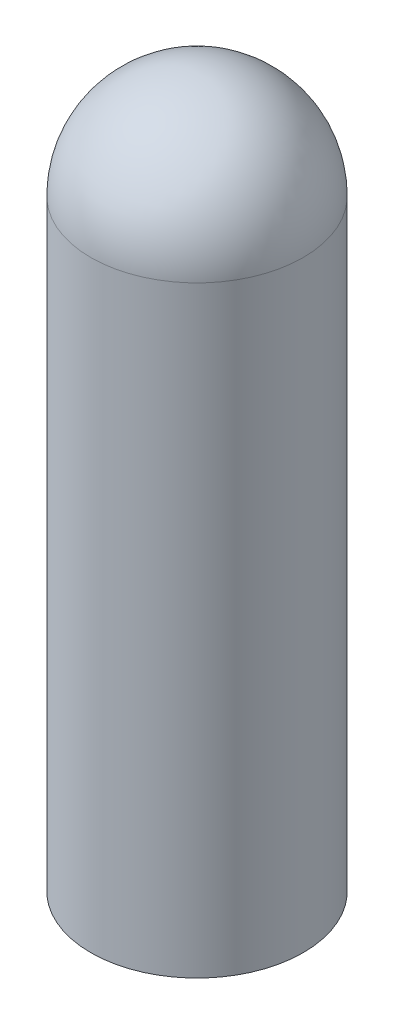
from build123d import *

# Parameters (mm, degrees)
SKETCH1_R           = 0.762
BOSS_EXTRUDE1_DEPTH = 5.08
FILLET1_R           = 0.762


with BuildPart() as part:
    # Sketch1 → Boss-Extrude1 (new body)
    with BuildSketch(Plane(origin=(0, 0, 0), x_dir=(1, 0, 0), z_dir=(0, 1, 0))):
        with Locations(Location((0, 0, 0), (0, 0, 270))):
            Circle(SKETCH1_R)
    extrude(amount=BOSS_EXTRUDE1_DEPTH)

    # Fillet1
    fillet1_edges = [part.edges().sort_by_distance(p)[0] for p in [
        (0, 5.08, -0.762),
    ]]
    fillet(fillet1_edges, radius=FILLET1_R)


solid = part.part
